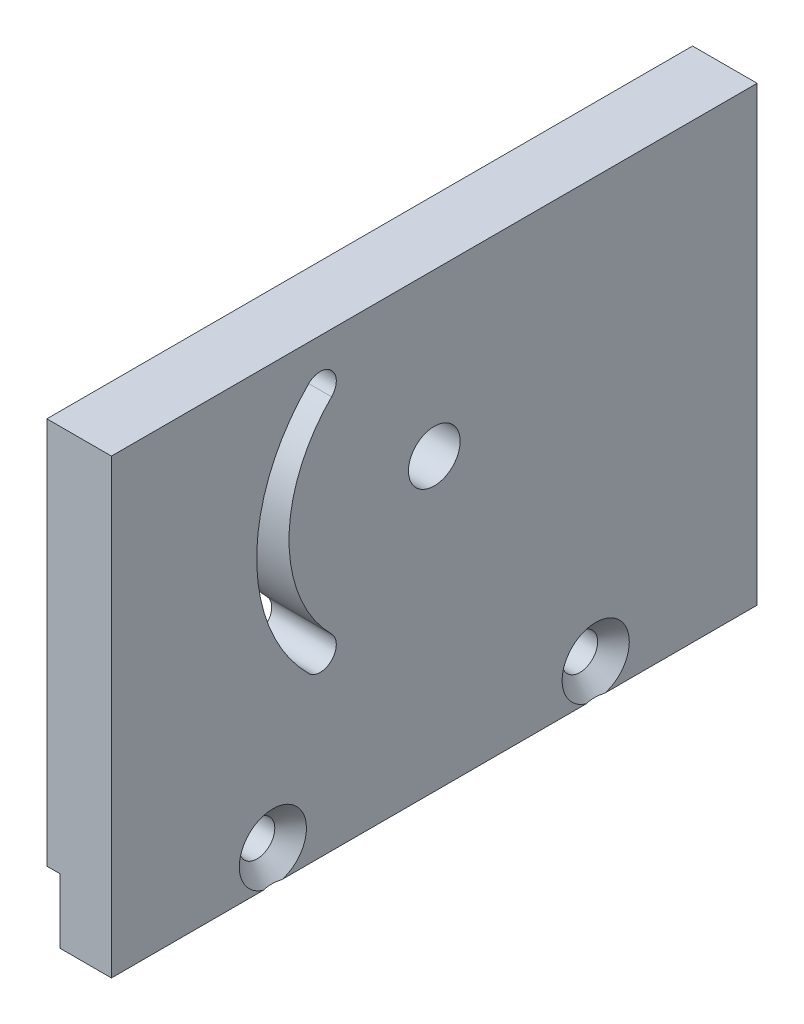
from build123d import *

# Parameters (mm, degrees)
BOSS_EXTRU_1_DEPTH                             = 100
FRAISAGE_POUR_VIS_T_TE_FRAIS_E_M51_D           = 5.5
FRAISAGE_POUR_VIS_T_TE_FRAIS_E_M51_CSINK_D     = 10.4
FRAISAGE_POUR_VIS_T_TE_FRAIS_E_M51_CSINK_ANGLE = 90
ESQUISSE4_R                                    = 4
ENL_V_MAT_EXTRU_1_DEPTH                        = 10
ENL_V_MAT_EXTRU_2_DEPTH                        = 123.474487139


with BuildPart() as part:
    # Esquisse1 → Boss.-Extru.1 (new body)
    with BuildSketch(Plane.XY):
        Polygon((68, 10), (68, 70), (78, 70), (78, 0), (70, 0), (70, 10), align=None)
    extrude(amount=-BOSS_EXTRU_1_DEPTH)

    # Fraisage pour vis _ t_te frais_e M51 (through all)
    with Locations(Plane(origin=(78, 0, 0), x_dir=(0, 0, -1), z_dir=(1, 0, 0))):
        with Locations((25, 5), (75, 5)):
            CounterSinkHole(FRAISAGE_POUR_VIS_T_TE_FRAIS_E_M51_D / 2, FRAISAGE_POUR_VIS_T_TE_FRAIS_E_M51_CSINK_D / 2, counter_sink_angle=FRAISAGE_POUR_VIS_T_TE_FRAIS_E_M51_CSINK_ANGLE)

    # Esquisse4 → Enl_v. mat.-Extru.1 (cut)
    with BuildSketch(Plane(origin=(78, 0, 0), x_dir=(0, 0, -1), z_dir=(1, 0, 0))):
        with Locations(Location((50, 45, 0), (0, 0, 90))):
            Circle(ESQUISSE4_R)
    extrude(amount=-ENL_V_MAT_EXTRU_1_DEPTH, mode=Mode.SUBTRACT)

    # Esquisse5 → Enl_v. mat.-Extru.2 (cut, through all)
    with BuildSketch(Plane(origin=(78, 0, 0), x_dir=(0, 0, -1), z_dir=(1, 0, 0))):
        with BuildLine():
            ThreePointArc((34.090097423, 60.909902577), (27.5, 45), (34.090097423, 29.090097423))
            ThreePointArc((34.090097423, 29.090097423), (34.090097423, 25.554563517), (30.554563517, 25.554563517))
            ThreePointArc((30.554563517, 25.554563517), (22.5, 45), (30.554563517, 64.445436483))
            ThreePointArc((30.554563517, 64.445436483), (34.090097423, 64.445436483), (34.090097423, 60.909902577))
        make_face()
    extrude(amount=-ENL_V_MAT_EXTRU_2_DEPTH, mode=Mode.SUBTRACT)


solid = part.part
